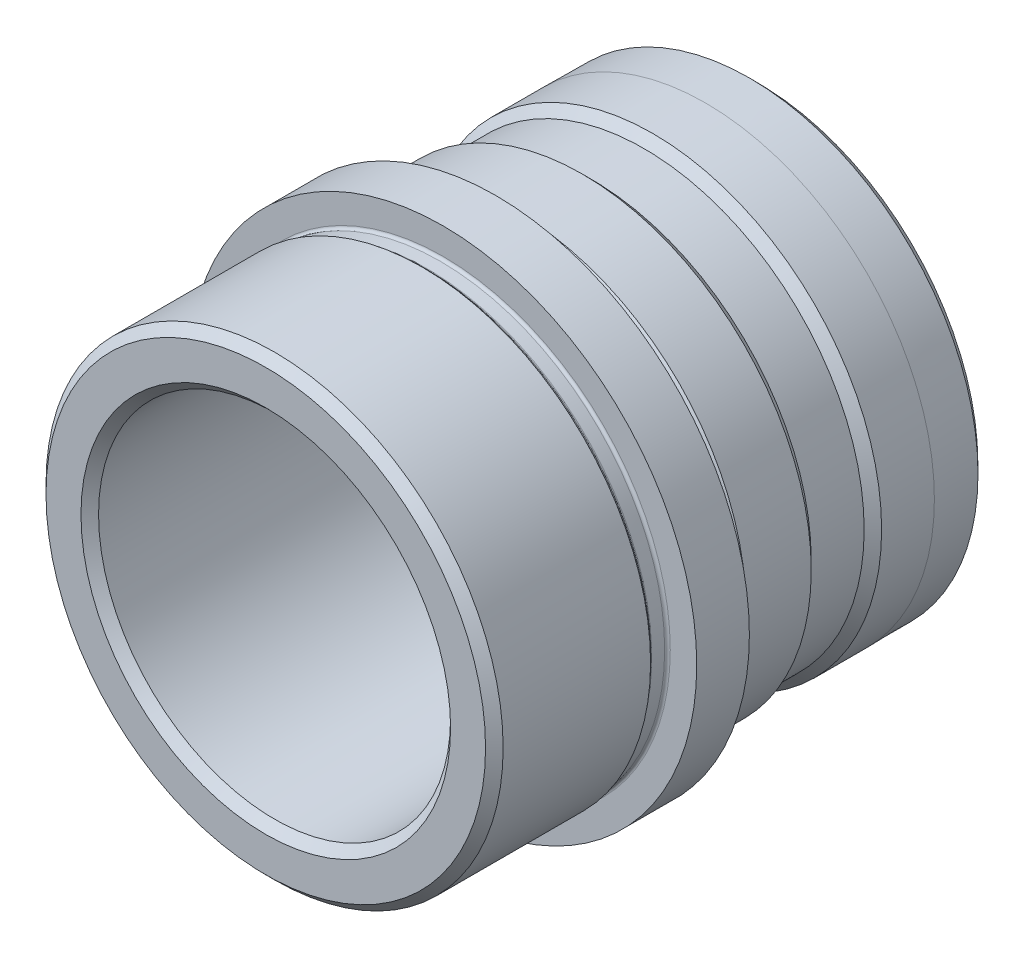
ISO-10303-21;
HEADER;
FILE_DESCRIPTION(('STEP AP214'),'2;1');
FILE_NAME('part.step','',(''),(''),'','','');
FILE_SCHEMA(('AUTOMOTIVE_DESIGN { 1 0 10303 214 1 1 1 1 }'));
ENDSEC;
DATA;
#1=APPLICATION_CONTEXT('core data for automotive mechanical design processes');
#2=APPLICATION_PROTOCOL_DEFINITION('international standard','automotive_design',2000,#1);
#3=PRODUCT_CONTEXT('',#1,'mechanical');
#4=PRODUCT('Part','Part','',(#3));
#5=PRODUCT_RELATED_PRODUCT_CATEGORY('part','',(#4));
#6=PRODUCT_DEFINITION_FORMATION('','',#4);
#7=PRODUCT_DEFINITION_CONTEXT('part definition',#1,'design');
#8=PRODUCT_DEFINITION('design','',#6,#7);
#9=PRODUCT_DEFINITION_SHAPE('','',#8);
#10=(LENGTH_UNIT() NAMED_UNIT(*) SI_UNIT(.MILLI.,.METRE.));
#11=(NAMED_UNIT(*) PLANE_ANGLE_UNIT() SI_UNIT($,.RADIAN.));
#12=(NAMED_UNIT(*) SI_UNIT($,.STERADIAN.) SOLID_ANGLE_UNIT());
#13=UNCERTAINTY_MEASURE_WITH_UNIT(LENGTH_MEASURE(1.E-05),#10,'distance_accuracy_value','');
#14=(GEOMETRIC_REPRESENTATION_CONTEXT(3) GLOBAL_UNCERTAINTY_ASSIGNED_CONTEXT((#13)) GLOBAL_UNIT_ASSIGNED_CONTEXT((#10,
#11,#12)) REPRESENTATION_CONTEXT('',''));
#15=CARTESIAN_POINT('',(0.,0.,0.));
#16=DIRECTION('',(0.,0.,1.));
#17=DIRECTION('',(1.,0.,0.));
#18=AXIS2_PLACEMENT_3D('',#15,#16,#17);
#19=CARTESIAN_POINT('',(0.,15.88262,16.002));
#20=DIRECTION('',(0.,0.,1.));
#21=DIRECTION('',(1.,0.,0.));
#22=AXIS2_PLACEMENT_3D('',#19,#20,#21);
#23=PLANE('',#22);
#24=CARTESIAN_POINT('',(0.,0.,16.002));
#25=DIRECTION('',(0.,0.,1.));
#26=DIRECTION('',(1.,0.,0.));
#27=AXIS2_PLACEMENT_3D('',#24,#25,#26);
#28=CIRCLE('',#27,19.83105);
#29=CARTESIAN_POINT('',(19.83105,0.,16.002));
#30=VERTEX_POINT('',#29);
#31=EDGE_CURVE('E66',#30,#30,#28,.T.);
#32=ORIENTED_EDGE('',*,*,#31,.T.);
#33=EDGE_LOOP('',(#32));
#34=FACE_BOUND('',#33,.T.);
#35=CARTESIAN_POINT('',(0.,0.,16.002));
#36=DIRECTION('',(0.,0.,1.));
#37=DIRECTION('',(1.,0.,0.));
#38=AXIS2_PLACEMENT_3D('',#35,#36,#37);
#39=CIRCLE('',#38,16.67637);
#40=CARTESIAN_POINT('',(16.67637,0.,16.002));
#41=VERTEX_POINT('',#40);
#42=EDGE_CURVE('E69',#41,#41,#39,.F.);
#43=ORIENTED_EDGE('',*,*,#42,.T.);
#44=EDGE_LOOP('',(#43));
#45=FACE_BOUND('',#44,.T.);
#46=ADVANCED_FACE('F31',(#34,#45),#23,.T.);
#47=CARTESIAN_POINT('',(0.,0.,0.));
#48=DIRECTION('',(0.,0.,-1.));
#49=DIRECTION('',(-1.,0.,0.));
#50=AXIS2_PLACEMENT_3D('',#47,#48,#49);
#51=CYLINDRICAL_SURFACE('',#50,20.6248);
#52=CARTESIAN_POINT('',(0.,0.,15.20825));
#53=DIRECTION('',(0.,0.,1.));
#54=DIRECTION('',(1.,0.,0.));
#55=AXIS2_PLACEMENT_3D('',#52,#53,#54);
#56=CIRCLE('',#55,20.6248);
#57=CARTESIAN_POINT('',(20.6248,0.,15.20825));
#58=VERTEX_POINT('',#57);
#59=EDGE_CURVE('E72',#58,#58,#56,.F.);
#60=ORIENTED_EDGE('',*,*,#59,.T.);
#61=EDGE_LOOP('',(#60));
#62=FACE_BOUND('',#61,.T.);
#63=CARTESIAN_POINT('',(0.,0.,1.905));
#64=DIRECTION('',(0.,0.,-1.));
#65=DIRECTION('',(-1.,0.,0.));
#66=AXIS2_PLACEMENT_3D('',#63,#64,#65);
#67=CIRCLE('',#66,20.6248);
#68=CARTESIAN_POINT('',(-20.6248,0.,1.905));
#69=VERTEX_POINT('',#68);
#70=EDGE_CURVE('E87',#69,#69,#67,.T.);
#71=ORIENTED_EDGE('',*,*,#70,.F.);
#72=EDGE_LOOP('',(#71));
#73=FACE_BOUND('',#72,.T.);
#74=ADVANCED_FACE('F156',(#62,#73),#51,.T.);
#75=CARTESIAN_POINT('',(0.,0.,1.524));
#76=DIRECTION('',(0.,0.,1.));
#77=DIRECTION('',(1.,0.,0.));
#78=AXIS2_PLACEMENT_3D('',#75,#76,#77);
#79=CONICAL_SURFACE('',#78,20.2438,0.785398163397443);
#80=CARTESIAN_POINT('',(0.,0.,1.59839487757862));
#81=DIRECTION('',(0.,0.,1.));
#82=DIRECTION('',(1.,0.,0.));
#83=AXIS2_PLACEMENT_3D('',#80,#81,#82);
#84=CIRCLE('',#83,20.3181948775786);
#85=CARTESIAN_POINT('',(20.3181948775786,0.,1.59839487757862));
#86=VERTEX_POINT('',#85);
#87=EDGE_CURVE('E38',#86,#86,#84,.T.);
#88=ORIENTED_EDGE('',*,*,#87,.T.);
#89=EDGE_LOOP('',(#88));
#90=FACE_BOUND('',#89,.T.);
#91=ORIENTED_EDGE('',*,*,#70,.T.);
#92=EDGE_LOOP('',(#91));
#93=FACE_BOUND('',#92,.T.);
#94=ADVANCED_FACE('F152',(#90,#93),#79,.T.);
#95=CARTESIAN_POINT('',(0.,0.,0.));
#96=DIRECTION('',(0.,0.,-1.));
#97=DIRECTION('',(-1.,0.,0.));
#98=AXIS2_PLACEMENT_3D('',#95,#96,#97);
#99=CYLINDRICAL_SURFACE('',#98,20.2438);
#100=CARTESIAN_POINT('',(0.,0.,1.41878975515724));
#101=DIRECTION('',(0.,0.,-1.));
#102=DIRECTION('',(-1.,0.,0.));
#103=AXIS2_PLACEMENT_3D('',#100,#101,#102);
#104=CIRCLE('',#103,20.2438);
#105=CARTESIAN_POINT('',(-20.2438,0.,1.41878975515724));
#106=VERTEX_POINT('',#105);
#107=EDGE_CURVE('E42',#106,#106,#104,.T.);
#108=ORIENTED_EDGE('',*,*,#107,.T.);
#109=EDGE_LOOP('',(#108));
#110=FACE_BOUND('',#109,.T.);
#111=CARTESIAN_POINT('',(0.,0.,0.254));
#112=DIRECTION('',(0.,0.,1.));
#113=DIRECTION('',(1.,0.,0.));
#114=AXIS2_PLACEMENT_3D('',#111,#112,#113);
#115=CIRCLE('',#114,20.2438);
#116=CARTESIAN_POINT('',(20.2438,0.,0.254));
#117=VERTEX_POINT('',#116);
#118=EDGE_CURVE('E46',#117,#117,#115,.T.);
#119=ORIENTED_EDGE('',*,*,#118,.T.);
#120=EDGE_LOOP('',(#119));
#121=FACE_BOUND('',#120,.T.);
#122=ADVANCED_FACE('F149',(#110,#121),#99,.T.);
#123=CARTESIAN_POINT('',(0.,22.8854,0.));
#124=DIRECTION('',(0.,0.,1.));
#125=DIRECTION('',(1.,0.,0.));
#126=AXIS2_PLACEMENT_3D('',#123,#124,#125);
#127=PLANE('',#126);
#128=CARTESIAN_POINT('',(0.,0.,0.));
#129=DIRECTION('',(0.,0.,1.));
#130=DIRECTION('',(1.,0.,0.));
#131=AXIS2_PLACEMENT_3D('',#128,#129,#130);
#132=CIRCLE('',#131,20.4978);
#133=CARTESIAN_POINT('',(20.4978,0.,0.));
#134=VERTEX_POINT('',#133);
#135=EDGE_CURVE('E10',#134,#134,#132,.F.);
#136=ORIENTED_EDGE('',*,*,#135,.T.);
#137=EDGE_LOOP('',(#136));
#138=FACE_BOUND('',#137,.T.);
#139=CARTESIAN_POINT('',(0.,0.,0.));
#140=DIRECTION('',(0.,0.,-1.));
#141=DIRECTION('',(-1.,0.,0.));
#142=AXIS2_PLACEMENT_3D('',#139,#140,#141);
#143=CIRCLE('',#142,22.8854);
#144=CARTESIAN_POINT('',(-22.8854,0.,0.));
#145=VERTEX_POINT('',#144);
#146=EDGE_CURVE('E386',#145,#145,#143,.T.);
#147=ORIENTED_EDGE('',*,*,#146,.F.);
#148=EDGE_LOOP('',(#147));
#149=FACE_BOUND('',#148,.T.);
#150=ADVANCED_FACE('F145',(#138,#149),#127,.T.);
#151=CARTESIAN_POINT('',(0.,0.,0.));
#152=DIRECTION('',(0.,0.,-1.));
#153=DIRECTION('',(-1.,0.,0.));
#154=AXIS2_PLACEMENT_3D('',#151,#152,#153);
#155=CYLINDRICAL_SURFACE('',#154,22.8854);
#156=ORIENTED_EDGE('',*,*,#146,.T.);
#157=EDGE_LOOP('',(#156));
#158=FACE_BOUND('',#157,.T.);
#159=CARTESIAN_POINT('',(0.,0.,-4.7498));
#160=DIRECTION('',(0.,0.,-1.));
#161=DIRECTION('',(-1.,0.,0.));
#162=AXIS2_PLACEMENT_3D('',#159,#160,#161);
#163=CIRCLE('',#162,22.8854);
#164=CARTESIAN_POINT('',(-22.8854,0.,-4.7498));
#165=VERTEX_POINT('',#164);
#166=EDGE_CURVE('E384',#165,#165,#163,.T.);
#167=ORIENTED_EDGE('',*,*,#166,.F.);
#168=EDGE_LOOP('',(#167));
#169=FACE_BOUND('',#168,.T.);
#170=ADVANCED_FACE('F141',(#158,#169),#155,.T.);
#171=CARTESIAN_POINT('',(0.,22.8854,-4.7498));
#172=DIRECTION('',(0.,0.,-1.));
#173=DIRECTION('',(-1.,0.,0.));
#174=AXIS2_PLACEMENT_3D('',#171,#172,#173);
#175=PLANE('',#174);
#176=CARTESIAN_POINT('',(0.,0.,-4.7498));
#177=DIRECTION('',(0.,0.,-1.));
#178=DIRECTION('',(-1.,0.,0.));
#179=AXIS2_PLACEMENT_3D('',#176,#177,#178);
#180=CIRCLE('',#179,20.4978);
#181=CARTESIAN_POINT('',(-20.4978,0.,-4.7498));
#182=VERTEX_POINT('',#181);
#183=EDGE_CURVE('E51',#182,#182,#180,.F.);
#184=ORIENTED_EDGE('',*,*,#183,.T.);
#185=EDGE_LOOP('',(#184));
#186=FACE_BOUND('',#185,.T.);
#187=ORIENTED_EDGE('',*,*,#166,.T.);
#188=EDGE_LOOP('',(#187));
#189=FACE_BOUND('',#188,.T.);
#190=ADVANCED_FACE('F137',(#186,#189),#175,.T.);
#191=CARTESIAN_POINT('',(0.,0.,0.));
#192=DIRECTION('',(0.,0.,-1.));
#193=DIRECTION('',(-1.,0.,0.));
#194=AXIS2_PLACEMENT_3D('',#191,#192,#193);
#195=CYLINDRICAL_SURFACE('',#194,20.2438);
#196=CARTESIAN_POINT('',(0.,0.,-6.16858975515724));
#197=DIRECTION('',(0.,0.,-1.));
#198=DIRECTION('',(-1.,0.,0.));
#199=AXIS2_PLACEMENT_3D('',#196,#197,#198);
#200=CIRCLE('',#199,20.2438);
#201=CARTESIAN_POINT('',(-20.2438,0.,-6.16858975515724));
#202=VERTEX_POINT('',#201);
#203=EDGE_CURVE('E54',#202,#202,#200,.F.);
#204=ORIENTED_EDGE('',*,*,#203,.T.);
#205=EDGE_LOOP('',(#204));
#206=FACE_BOUND('',#205,.T.);
#207=CARTESIAN_POINT('',(0.,0.,-5.0038));
#208=DIRECTION('',(0.,0.,-1.));
#209=DIRECTION('',(-1.,0.,0.));
#210=AXIS2_PLACEMENT_3D('',#207,#208,#209);
#211=CIRCLE('',#210,20.2438);
#212=CARTESIAN_POINT('',(-20.2438,0.,-5.0038));
#213=VERTEX_POINT('',#212);
#214=EDGE_CURVE('E57',#213,#213,#211,.T.);
#215=ORIENTED_EDGE('',*,*,#214,.T.);
#216=EDGE_LOOP('',(#215));
#217=FACE_BOUND('',#216,.T.);
#218=ADVANCED_FACE('F133',(#206,#217),#195,.T.);
#219=CARTESIAN_POINT('',(0.,0.,-6.67385));
#220=DIRECTION('',(0.,0.,-1.));
#221=DIRECTION('',(-1.,0.,0.));
#222=AXIS2_PLACEMENT_3D('',#219,#220,#221);
#223=CONICAL_SURFACE('',#222,20.64385,0.78539816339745);
#224=CARTESIAN_POINT('',(0.,0.,-6.34819487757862));
#225=DIRECTION('',(0.,0.,-1.));
#226=DIRECTION('',(-1.,0.,0.));
#227=AXIS2_PLACEMENT_3D('',#224,#225,#226);
#228=CIRCLE('',#227,20.3181948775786);
#229=CARTESIAN_POINT('',(-20.3181948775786,0.,-6.34819487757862));
#230=VERTEX_POINT('',#229);
#231=EDGE_CURVE('E60',#230,#230,#228,.T.);
#232=ORIENTED_EDGE('',*,*,#231,.T.);
#233=EDGE_LOOP('',(#232));
#234=FACE_BOUND('',#233,.T.);
#235=CARTESIAN_POINT('',(0.,0.,-6.67385));
#236=DIRECTION('',(0.,0.,-1.));
#237=DIRECTION('',(-1.,0.,0.));
#238=AXIS2_PLACEMENT_3D('',#235,#236,#237);
#239=CIRCLE('',#238,20.64385);
#240=CARTESIAN_POINT('',(-20.64385,0.,-6.67385));
#241=VERTEX_POINT('',#240);
#242=EDGE_CURVE('E381',#241,#241,#239,.T.);
#243=ORIENTED_EDGE('',*,*,#242,.F.);
#244=EDGE_LOOP('',(#243));
#245=FACE_BOUND('',#244,.T.);
#246=ADVANCED_FACE('F129',(#234,#245),#223,.T.);
#247=CARTESIAN_POINT('',(0.,0.,0.));
#248=DIRECTION('',(0.,0.,-1.));
#249=DIRECTION('',(-1.,0.,0.));
#250=AXIS2_PLACEMENT_3D('',#247,#248,#249);
#251=CYLINDRICAL_SURFACE('',#250,20.64385);
#252=ORIENTED_EDGE('',*,*,#242,.T.);
#253=EDGE_LOOP('',(#252));
#254=FACE_BOUND('',#253,.T.);
#255=CARTESIAN_POINT('',(0.,0.,-12.573));
#256=DIRECTION('',(0.,0.,-1.));
#257=DIRECTION('',(-1.,0.,0.));
#258=AXIS2_PLACEMENT_3D('',#255,#256,#257);
#259=CIRCLE('',#258,20.64385);
#260=CARTESIAN_POINT('',(-20.64385,0.,-12.573));
#261=VERTEX_POINT('',#260);
#262=EDGE_CURVE('E378',#261,#261,#259,.T.);
#263=ORIENTED_EDGE('',*,*,#262,.F.);
#264=EDGE_LOOP('',(#263));
#265=FACE_BOUND('',#264,.T.);
#266=ADVANCED_FACE('F125',(#254,#265),#251,.T.);
#267=CARTESIAN_POINT('',(0.,0.,-13.3604));
#268=DIRECTION('',(0.,0.,1.));
#269=DIRECTION('',(1.,0.,0.));
#270=AXIS2_PLACEMENT_3D('',#267,#268,#269);
#271=CONICAL_SURFACE('',#270,19.85645,0.785398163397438);
#272=ORIENTED_EDGE('',*,*,#262,.T.);
#273=EDGE_LOOP('',(#272));
#274=FACE_BOUND('',#273,.T.);
#275=CARTESIAN_POINT('',(0.,0.,-13.3604));
#276=DIRECTION('',(0.,0.,-1.));
#277=DIRECTION('',(-1.,0.,0.));
#278=AXIS2_PLACEMENT_3D('',#275,#276,#277);
#279=CIRCLE('',#278,19.85645);
#280=CARTESIAN_POINT('',(-19.85645,0.,-13.3604));
#281=VERTEX_POINT('',#280);
#282=EDGE_CURVE('E372',#281,#281,#279,.T.);
#283=ORIENTED_EDGE('',*,*,#282,.F.);
#284=EDGE_LOOP('',(#283));
#285=FACE_BOUND('',#284,.T.);
#286=ADVANCED_FACE('F120',(#274,#285),#271,.T.);
#287=CARTESIAN_POINT('',(0.,0.,0.));
#288=DIRECTION('',(0.,0.,-1.));
#289=DIRECTION('',(-1.,0.,0.));
#290=AXIS2_PLACEMENT_3D('',#287,#288,#289);
#291=CYLINDRICAL_SURFACE('',#290,19.85645);
#292=CARTESIAN_POINT('',(0.,-19.85645,-13.3731));
#293=CARTESIAN_POINT('',(-0.132890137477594,-19.856448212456,-13.373105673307));
#294=CARTESIAN_POINT('',(-0.265864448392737,-19.8551018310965,-13.3842916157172));
#295=CARTESIAN_POINT('',(-0.528116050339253,-19.8498603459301,-13.4287397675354));
#296=CARTESIAN_POINT('',(-0.657389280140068,-19.8459625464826,-13.4620253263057));
#297=CARTESIAN_POINT('',(-0.90840387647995,-19.8360575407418,-13.5496807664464));
#298=CARTESIAN_POINT('',(-1.03015013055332,-19.8300517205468,-13.6040367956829));
#299=CARTESIAN_POINT('',(-1.26276829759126,-19.8165994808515,-13.7322606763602));
#300=CARTESIAN_POINT('',(-1.37364214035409,-19.809153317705,-13.8061250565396));
#301=CARTESIAN_POINT('',(-1.5819530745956,-19.7936102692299,-13.9716687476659));
#302=CARTESIAN_POINT('',(-1.67932726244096,-19.7855105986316,-14.0634269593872));
#303=CARTESIAN_POINT('',(-1.85733327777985,-19.7695960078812,-14.2619844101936));
#304=CARTESIAN_POINT('',(-1.93796427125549,-19.7617811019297,-14.3687843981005));
#305=CARTESIAN_POINT('',(-2.08042697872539,-19.747293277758,-14.5947993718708));
#306=CARTESIAN_POINT('',(-2.14220018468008,-19.7406239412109,-14.7140514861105));
#307=CARTESIAN_POINT('',(-2.24482018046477,-19.729218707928,-14.9613298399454));
#308=CARTESIAN_POINT('',(-2.28566769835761,-19.7244827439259,-15.0893557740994));
#309=CARTESIAN_POINT('',(-2.34508662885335,-19.7175068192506,-15.3498969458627));
#310=CARTESIAN_POINT('',(-2.36376388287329,-19.7152550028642,-15.482387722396));
#311=CARTESIAN_POINT('',(-2.37863953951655,-19.7134659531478,-15.7486409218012));
#312=CARTESIAN_POINT('',(-2.37483877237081,-19.7139286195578,-15.8824032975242));
#313=CARTESIAN_POINT('',(-2.34495323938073,-19.7175054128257,-16.146666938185));
#314=CARTESIAN_POINT('',(-2.3189848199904,-19.7206056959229,-16.2771815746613));
#315=CARTESIAN_POINT('',(-2.24568254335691,-19.7290868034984,-16.5319870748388));
#316=CARTESIAN_POINT('',(-2.19834828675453,-19.7344676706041,-16.6562778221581));
#317=CARTESIAN_POINT('',(-2.08353213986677,-19.7469194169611,-16.8954702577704));
#318=CARTESIAN_POINT('',(-2.01599944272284,-19.7539945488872,-17.0103473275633));
#319=CARTESIAN_POINT('',(-1.86273980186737,-19.7690342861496,-17.2271817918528));
#320=CARTESIAN_POINT('',(-1.77701209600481,-19.7769989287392,-17.3291386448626));
#321=CARTESIAN_POINT('',(-1.58914995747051,-19.7929818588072,-17.5179139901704));
#322=CARTESIAN_POINT('',(-1.48691519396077,-19.8010001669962,-17.6046326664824));
#323=CARTESIAN_POINT('',(-1.26928714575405,-19.8161397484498,-17.7596936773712));
#324=CARTESIAN_POINT('',(-1.15389383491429,-19.8232610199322,-17.8280359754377));
#325=CARTESIAN_POINT('',(-0.913149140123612,-19.8358080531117,-17.944403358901));
#326=CARTESIAN_POINT('',(-0.787794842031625,-19.8412333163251,-17.9924224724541));
#327=CARTESIAN_POINT('',(-0.530723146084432,-19.8497724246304,-18.0667025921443));
#328=CARTESIAN_POINT('',(-0.399006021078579,-19.8528863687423,-18.092964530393));
#329=CARTESIAN_POINT('',(-0.133811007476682,-19.8564391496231,-18.1228560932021));
#330=CARTESIAN_POINT('',(-0.000348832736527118,-19.8568942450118,-18.1266232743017));
#331=CARTESIAN_POINT('',(0.26530501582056,-19.8551218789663,-18.1117809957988));
#332=CARTESIAN_POINT('',(0.397496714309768,-19.8528944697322,-18.0931719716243));
#333=CARTESIAN_POINT('',(0.656453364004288,-19.8460175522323,-18.034219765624));
#334=CARTESIAN_POINT('',(0.783233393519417,-19.8413753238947,-17.9939418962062));
#335=CARTESIAN_POINT('',(1.02823890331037,-19.8301887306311,-17.8928630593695));
#336=CARTESIAN_POINT('',(1.14646411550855,-19.8236443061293,-17.8320614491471));
#337=CARTESIAN_POINT('',(1.37162013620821,-19.8093429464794,-17.6913263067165));
#338=CARTESIAN_POINT('',(1.47849476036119,-19.8015804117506,-17.6113034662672));
#339=CARTESIAN_POINT('',(1.67734488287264,-19.7857294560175,-17.4345241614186));
#340=CARTESIAN_POINT('',(1.76931984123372,-19.7776410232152,-17.3377670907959));
#341=CARTESIAN_POINT('',(1.93624541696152,-19.7620000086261,-17.1296612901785));
#342=CARTESIAN_POINT('',(2.01110505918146,-19.7544504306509,-17.0182393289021));
#343=CARTESIAN_POINT('',(2.14104724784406,-19.7407905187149,-16.7843233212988));
#344=CARTESIAN_POINT('',(2.19613016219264,-19.7346801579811,-16.6618294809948));
#345=CARTESIAN_POINT('',(2.28480682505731,-19.7246106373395,-16.40954471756));
#346=CARTESIAN_POINT('',(2.3184525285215,-19.7206462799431,-16.2797722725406));
#347=CARTESIAN_POINT('',(2.363467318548,-19.7153024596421,-16.0163693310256));
#348=CARTESIAN_POINT('',(2.37483734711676,-19.7139228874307,-15.8827389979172));
#349=CARTESIAN_POINT('',(2.37496174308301,-19.7139078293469,-15.6163183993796));
#350=CARTESIAN_POINT('',(2.36385902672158,-19.7152550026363,-15.4835281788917));
#351=CARTESIAN_POINT('',(2.31965504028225,-19.7205044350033,-15.2217152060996));
#352=CARTESIAN_POINT('',(2.28655376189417,-19.7244066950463,-15.0926924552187));
#353=CARTESIAN_POINT('',(2.19933577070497,-19.7343213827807,-14.8420916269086));
#354=CARTESIAN_POINT('',(2.14522532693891,-19.7403331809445,-14.7205113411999));
#355=CARTESIAN_POINT('',(2.01753913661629,-19.7537906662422,-14.4881338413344));
#356=CARTESIAN_POINT('',(1.9439632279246,-19.7612363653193,-14.3773367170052));
#357=CARTESIAN_POINT('',(1.77890262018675,-19.776779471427,-14.1689394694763));
#358=CARTESIAN_POINT('',(1.68731134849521,-19.7848805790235,-14.0714240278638));
#359=CARTESIAN_POINT('',(1.48904061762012,-19.8007887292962,-13.8930907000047));
#360=CARTESIAN_POINT('',(1.38235759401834,-19.8085957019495,-13.8122767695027));
#361=CARTESIAN_POINT('',(1.15650780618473,-19.82306574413,-13.6694035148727));
#362=CARTESIAN_POINT('',(1.03729874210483,-19.8297247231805,-13.6074106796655));
#363=CARTESIAN_POINT('',(0.79015156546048,-19.8411065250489,-13.50441032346));
#364=CARTESIAN_POINT('',(0.66222319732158,-19.8458314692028,-13.4633797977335));
#365=CARTESIAN_POINT('',(0.444681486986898,-19.8516624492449,-13.4133868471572));
#366=CARTESIAN_POINT('',(0.356444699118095,-19.8534491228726,-13.3983007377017));
#367=CARTESIAN_POINT('',(0.178817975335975,-19.8558434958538,-13.3781554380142));
#368=CARTESIAN_POINT('',(0.0894280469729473,-19.8564512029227,-13.3730961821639));
#369=CARTESIAN_POINT('',(0.,-19.85645,-13.3731));
#370=B_SPLINE_CURVE_WITH_KNOTS('',3,(#292,#293,#294,#295,#296,#297,#298,#299,#300,#301,#302,
#303,#304,#305,#306,#307,#308,#309,#310,#311,#312,#313,#314,#315,#316,#317,#318,#319,#320,#321,
#322,#323,#324,#325,#326,#327,#328,#329,#330,#331,#332,#333,#334,#335,#336,#337,#338,#339,#340,
#341,#342,#343,#344,#345,#346,#347,#348,#349,#350,#351,#352,#353,#354,#355,#356,#357,#358,#359,
#360,#361,#362,#363,#364,#365,#366,#367,#368,#369),.UNSPECIFIED.,.T.,.F.,(4,2,2,2,2,2,2,2,2,2,2,
2,2,2,2,2,2,2,2,2,2,2,2,2,2,2,2,2,2,2,2,2,2,2,2,2,2,2,4),(0.,0.398343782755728,
0.797109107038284,1.19561271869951,1.59404546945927,1.99427649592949,2.39452745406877,
2.79600789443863,3.19747436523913,3.59701641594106,3.99654370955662,4.39398689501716,
4.79143750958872,5.18989639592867,5.58837197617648,5.98936759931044,6.39036401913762,
6.79147818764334,7.19257517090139,7.5912168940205,7.98985085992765,8.38728997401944,
8.78474153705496,9.18407678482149,9.58342650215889,9.98485198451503,10.3862699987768,
10.7867114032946,11.1871358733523,11.5850218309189,11.9829079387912,12.380675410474,
12.7784461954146,13.1786449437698,13.5789383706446,13.9806298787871,14.3818796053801,
14.6499456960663,14.918010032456),.UNSPECIFIED.);
#371=CARTESIAN_POINT('',(0.,-19.85645,-13.3731));
#372=VERTEX_POINT('',#371);
#373=EDGE_CURVE('E95',#372,#372,#370,.T.);
#374=ORIENTED_EDGE('',*,*,#373,.F.);
#375=EDGE_LOOP('',(#374));
#376=FACE_BOUND('',#375,.T.);
#377=ORIENTED_EDGE('',*,*,#282,.T.);
#378=EDGE_LOOP('',(#377));
#379=FACE_BOUND('',#378,.T.);
#380=CARTESIAN_POINT('',(0.,0.,-18.1356));
#381=DIRECTION('',(0.,0.,-1.));
#382=DIRECTION('',(-1.,0.,0.));
#383=AXIS2_PLACEMENT_3D('',#380,#381,#382);
#384=CIRCLE('',#383,19.85645);
#385=CARTESIAN_POINT('',(-19.85645,0.,-18.1356));
#386=VERTEX_POINT('',#385);
#387=EDGE_CURVE('E368',#386,#386,#384,.T.);
#388=ORIENTED_EDGE('',*,*,#387,.F.);
#389=EDGE_LOOP('',(#388));
#390=FACE_BOUND('',#389,.T.);
#391=ADVANCED_FACE('F114',(#376,#379,#390),#291,.T.);
#392=CARTESIAN_POINT('',(0.,0.,-18.923));
#393=DIRECTION('',(0.,0.,-1.));
#394=DIRECTION('',(-1.,0.,0.));
#395=AXIS2_PLACEMENT_3D('',#392,#393,#394);
#396=CONICAL_SURFACE('',#395,20.64385,0.785398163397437);
#397=ORIENTED_EDGE('',*,*,#387,.T.);
#398=EDGE_LOOP('',(#397));
#399=FACE_BOUND('',#398,.T.);
#400=CARTESIAN_POINT('',(0.,0.,-18.923));
#401=DIRECTION('',(0.,0.,-1.));
#402=DIRECTION('',(-1.,0.,0.));
#403=AXIS2_PLACEMENT_3D('',#400,#401,#402);
#404=CIRCLE('',#403,20.64385);
#405=CARTESIAN_POINT('',(-20.64385,0.,-18.923));
#406=VERTEX_POINT('',#405);
#407=EDGE_CURVE('E371',#406,#406,#404,.T.);
#408=ORIENTED_EDGE('',*,*,#407,.F.);
#409=EDGE_LOOP('',(#408));
#410=FACE_BOUND('',#409,.T.);
#411=ADVANCED_FACE('F119',(#399,#410),#396,.T.);
#412=CARTESIAN_POINT('',(0.,0.,0.));
#413=DIRECTION('',(0.,0.,-1.));
#414=DIRECTION('',(-1.,0.,0.));
#415=AXIS2_PLACEMENT_3D('',#412,#413,#414);
#416=CYLINDRICAL_SURFACE('',#415,20.64385);
#417=ORIENTED_EDGE('',*,*,#407,.T.);
#418=EDGE_LOOP('',(#417));
#419=FACE_BOUND('',#418,.T.);
#420=CARTESIAN_POINT('',(0.,0.,-23.6855));
#421=DIRECTION('',(0.,0.,-1.));
#422=DIRECTION('',(-1.,0.,0.));
#423=AXIS2_PLACEMENT_3D('',#420,#421,#422);
#424=CIRCLE('',#423,20.64385);
#425=CARTESIAN_POINT('',(-20.64385,0.,-23.6855));
#426=VERTEX_POINT('',#425);
#427=EDGE_CURVE('E112',#426,#426,#424,.T.);
#428=ORIENTED_EDGE('',*,*,#427,.F.);
#429=EDGE_LOOP('',(#428));
#430=FACE_BOUND('',#429,.T.);
#431=ADVANCED_FACE('F301',(#419,#430),#416,.T.);
#432=CARTESIAN_POINT('',(0.,0.,-28.448));
#433=DIRECTION('',(0.,0.,1.));
#434=DIRECTION('',(1.,0.,0.));
#435=AXIS2_PLACEMENT_3D('',#432,#433,#434);
#436=CONICAL_SURFACE('',#435,20.6022882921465,0.00872664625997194);
#437=CARTESIAN_POINT('',(0.,0.,-27.6542802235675));
#438=DIRECTION('',(0.,0.,-1.));
#439=DIRECTION('',(-1.,0.,0.));
#440=AXIS2_PLACEMENT_3D('',#437,#438,#439);
#441=CIRCLE('',#440,20.6092149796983);
#442=CARTESIAN_POINT('',(-20.6092149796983,0.,-27.6542802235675));
#443=VERTEX_POINT('',#442);
#444=EDGE_CURVE('E75',#443,#443,#441,.F.);
#445=ORIENTED_EDGE('',*,*,#444,.T.);
#446=EDGE_LOOP('',(#445));
#447=FACE_BOUND('',#446,.T.);
#448=ORIENTED_EDGE('',*,*,#427,.T.);
#449=EDGE_LOOP('',(#448));
#450=FACE_BOUND('',#449,.T.);
#451=ADVANCED_FACE('F292',(#447,#450),#436,.T.);
#452=CARTESIAN_POINT('',(0.,20.6022882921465,-28.448));
#453=DIRECTION('',(0.,0.,-1.));
#454=DIRECTION('',(-1.,0.,0.));
#455=AXIS2_PLACEMENT_3D('',#452,#453,#454);
#456=PLANE('',#455);
#457=CARTESIAN_POINT('',(0.,0.,-28.448));
#458=DIRECTION('',(0.,0.,-1.));
#459=DIRECTION('',(-1.,0.,0.));
#460=AXIS2_PLACEMENT_3D('',#457,#458,#459);
#461=CIRCLE('',#460,19.8015198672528);
#462=CARTESIAN_POINT('',(-19.8015198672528,0.,-28.448));
#463=VERTEX_POINT('',#462);
#464=EDGE_CURVE('E78',#463,#463,#461,.T.);
#465=ORIENTED_EDGE('',*,*,#464,.T.);
#466=EDGE_LOOP('',(#465));
#467=FACE_BOUND('',#466,.T.);
#468=CARTESIAN_POINT('',(0.,0.,-28.448));
#469=DIRECTION('',(0.,0.,-1.));
#470=DIRECTION('',(-1.,0.,0.));
#471=AXIS2_PLACEMENT_3D('',#468,#469,#470);
#472=CIRCLE('',#471,18.93062);
#473=CARTESIAN_POINT('',(-18.93062,0.,-28.448));
#474=VERTEX_POINT('',#473);
#475=EDGE_CURVE('E81',#474,#474,#472,.F.);
#476=ORIENTED_EDGE('',*,*,#475,.T.);
#477=EDGE_LOOP('',(#476));
#478=FACE_BOUND('',#477,.T.);
#479=ADVANCED_FACE('F282',(#467,#478),#456,.T.);
#480=CARTESIAN_POINT('',(0.,0.,0.));
#481=DIRECTION('',(0.,0.,-1.));
#482=DIRECTION('',(-1.,0.,0.));
#483=AXIS2_PLACEMENT_3D('',#480,#481,#482);
#484=CYLINDRICAL_SURFACE('',#483,15.88262);
#485=CARTESIAN_POINT('',(0.,0.,15.20825));
#486=DIRECTION('',(0.,0.,1.));
#487=DIRECTION('',(1.,0.,0.));
#488=AXIS2_PLACEMENT_3D('',#485,#486,#487);
#489=CIRCLE('',#488,15.88262);
#490=CARTESIAN_POINT('',(15.88262,0.,15.20825));
#491=VERTEX_POINT('',#490);
#492=EDGE_CURVE('E63',#491,#491,#489,.T.);
#493=ORIENTED_EDGE('',*,*,#492,.T.);
#494=EDGE_LOOP('',(#493));
#495=FACE_BOUND('',#494,.T.);
#496=CARTESIAN_POINT('',(0.,0.,-25.4));
#497=DIRECTION('',(0.,0.,-1.));
#498=DIRECTION('',(-1.,0.,0.));
#499=AXIS2_PLACEMENT_3D('',#496,#497,#498);
#500=CIRCLE('',#499,15.88262);
#501=CARTESIAN_POINT('',(-15.88262,0.,-25.4));
#502=VERTEX_POINT('',#501);
#503=EDGE_CURVE('E84',#502,#502,#500,.T.);
#504=ORIENTED_EDGE('',*,*,#503,.T.);
#505=EDGE_LOOP('',(#504));
#506=FACE_BOUND('',#505,.T.);
#507=CARTESIAN_POINT('',(0.,-15.88262,-13.3731));
#508=CARTESIAN_POINT('',(0.132605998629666,-15.8826178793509,-13.373105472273));
#509=CARTESIAN_POINT('',(0.265289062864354,-15.8809418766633,-13.3842438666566));
#510=CARTESIAN_POINT('',(0.526946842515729,-15.8744172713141,-13.4284920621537));
#511=CARTESIAN_POINT('',(0.65591781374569,-15.8695655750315,-13.461623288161));
#512=CARTESIAN_POINT('',(0.906326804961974,-15.8572348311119,-13.5488453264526));
#513=CARTESIAN_POINT('',(1.02777042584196,-15.849757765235,-13.6029203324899));
#514=CARTESIAN_POINT('',(1.25984133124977,-15.8330026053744,-13.7304563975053));
#515=CARTESIAN_POINT('',(1.37047012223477,-15.82372476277,-13.8039147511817));
#516=CARTESIAN_POINT('',(1.57864869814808,-15.8043192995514,-13.9687401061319));
#517=CARTESIAN_POINT('',(1.6761023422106,-15.7941862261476,-14.0602279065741));
#518=CARTESIAN_POINT('',(1.85433481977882,-15.7742550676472,-14.2582552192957));
#519=CARTESIAN_POINT('',(1.93511269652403,-15.7644570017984,-14.3647955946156));
#520=CARTESIAN_POINT('',(2.07807457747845,-15.7462522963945,-14.5905493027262));
#521=CARTESIAN_POINT('',(2.14016562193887,-15.737852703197,-14.7098221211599));
#522=CARTESIAN_POINT('',(2.24339724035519,-15.7234703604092,-14.9572501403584));
#523=CARTESIAN_POINT('',(2.28453894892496,-15.7174874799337,-15.0854048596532));
#524=CARTESIAN_POINT('',(2.34440558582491,-15.7086695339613,-15.3459480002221));
#525=CARTESIAN_POINT('',(2.36329506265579,-15.7058113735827,-15.4782978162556));
#526=CARTESIAN_POINT('',(2.37863077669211,-15.7034963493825,-15.7443171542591));
#527=CARTESIAN_POINT('',(2.37507829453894,-15.7040392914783,-15.8779866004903));
#528=CARTESIAN_POINT('',(2.34576541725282,-15.7084440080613,-16.1416887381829));
#529=CARTESIAN_POINT('',(2.32018824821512,-15.7122783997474,-16.2717423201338));
#530=CARTESIAN_POINT('',(2.24783884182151,-15.7227912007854,-16.5256909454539));
#531=CARTESIAN_POINT('',(2.20106600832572,-15.7294696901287,-16.6495858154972));
#532=CARTESIAN_POINT('',(2.08746228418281,-15.7449484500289,-16.8882578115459));
#533=CARTESIAN_POINT('',(2.02055374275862,-15.7537569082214,-17.0029974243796));
#534=CARTESIAN_POINT('',(1.86863319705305,-15.772497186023,-17.2196901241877));
#535=CARTESIAN_POINT('',(1.78362001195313,-15.7824290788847,-17.3216423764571));
#536=CARTESIAN_POINT('',(1.59689743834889,-15.8024181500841,-17.5109282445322));
#537=CARTESIAN_POINT('',(1.49503051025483,-15.8124755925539,-17.598106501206));
#538=CARTESIAN_POINT('',(1.27802912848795,-15.8314908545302,-17.7541533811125));
#539=CARTESIAN_POINT('',(1.16289461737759,-15.8404486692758,-17.8230219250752));
#540=CARTESIAN_POINT('',(0.922491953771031,-15.8562646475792,-17.9405022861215));
#541=CARTESIAN_POINT('',(0.797217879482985,-15.863121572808,-17.9891021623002));
#542=CARTESIAN_POINT('',(0.54016087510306,-15.8739528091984,-18.0645307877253));
#543=CARTESIAN_POINT('',(0.408378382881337,-15.8779273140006,-18.0913609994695));
#544=CARTESIAN_POINT('',(0.143386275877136,-15.8825202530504,-18.1222822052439));
#545=CARTESIAN_POINT('',(0.0102021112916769,-15.8831702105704,-18.1265867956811));
#546=CARTESIAN_POINT('',(-0.254986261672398,-15.881126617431,-18.11290145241));
#547=CARTESIAN_POINT('',(-0.386990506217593,-15.8784331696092,-18.0949122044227));
#548=CARTESIAN_POINT('',(-0.645425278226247,-15.8700249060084,-18.0373274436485));
#549=CARTESIAN_POINT('',(-0.771879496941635,-15.8643246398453,-17.9978359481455));
#550=CARTESIAN_POINT('',(-1.01637180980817,-15.8505398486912,-17.8984773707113));
#551=CARTESIAN_POINT('',(-1.13440951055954,-15.8424552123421,-17.8386093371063));
#552=CARTESIAN_POINT('',(-1.35965765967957,-15.8247218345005,-17.6996956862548));
#553=CARTESIAN_POINT('',(-1.46678364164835,-15.8150622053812,-17.6205145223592));
#554=CARTESIAN_POINT('',(-1.66630292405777,-15.795288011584,-17.4454110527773));
#555=CARTESIAN_POINT('',(-1.7586953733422,-15.7851734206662,-17.3494877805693));
#556=CARTESIAN_POINT('',(-1.92690171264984,-15.7655293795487,-17.1426723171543));
#557=CARTESIAN_POINT('',(-2.00257245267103,-15.7560054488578,-17.0316630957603));
#558=CARTESIAN_POINT('',(-2.13419246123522,-15.7387186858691,-16.7983840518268));
#559=CARTESIAN_POINT('',(-2.1901422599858,-15.7309558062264,-16.6761145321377));
#560=CARTESIAN_POINT('',(-2.28051011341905,-15.7181099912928,-16.4242132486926));
#561=CARTESIAN_POINT('',(-2.3150036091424,-15.7130176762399,-16.294609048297));
#562=CARTESIAN_POINT('',(-2.36171987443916,-15.7060645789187,-16.0313653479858));
#563=CARTESIAN_POINT('',(-2.37394417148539,-15.7042035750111,-15.8977261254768));
#564=CARTESIAN_POINT('',(-2.37573886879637,-15.7039320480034,-15.631632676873));
#565=CARTESIAN_POINT('',(-2.36553434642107,-15.7054872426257,-15.4991799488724));
#566=CARTESIAN_POINT('',(-2.32324328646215,-15.711798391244,-15.237896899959));
#567=CARTESIAN_POINT('',(-2.29115678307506,-15.7165543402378,-15.1090665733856));
#568=CARTESIAN_POINT('',(-2.20609198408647,-15.728719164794,-14.8587470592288));
#569=CARTESIAN_POINT('',(-2.1531293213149,-15.7361260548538,-14.7372524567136));
#570=CARTESIAN_POINT('',(-2.02783801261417,-15.7527606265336,-14.5048371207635));
#571=CARTESIAN_POINT('',(-1.95550871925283,-15.7619883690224,-14.3939167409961));
#572=CARTESIAN_POINT('',(-1.79271923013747,-15.7813351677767,-14.1846547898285));
#573=CARTESIAN_POINT('',(-1.7020923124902,-15.7914619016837,-14.0864436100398));
#574=CARTESIAN_POINT('',(-1.50563242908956,-15.8114014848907,-13.9065431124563));
#575=CARTESIAN_POINT('',(-1.39979593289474,-15.8212142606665,-13.8248576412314));
#576=CARTESIAN_POINT('',(-1.17524072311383,-15.8394815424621,-13.6799286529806));
#577=CARTESIAN_POINT('',(-1.05645473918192,-15.8479283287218,-13.616788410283));
#578=CARTESIAN_POINT('',(-0.809893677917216,-15.8624361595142,-13.5114497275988));
#579=CARTESIAN_POINT('',(-0.682128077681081,-15.8684996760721,-13.4692295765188));
#580=CARTESIAN_POINT('',(-0.461489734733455,-15.8761721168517,-13.4165183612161));
#581=CARTESIAN_POINT('',(-0.369979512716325,-15.8785776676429,-13.4002613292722));
#582=CARTESIAN_POINT('',(-0.185658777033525,-15.881802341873,-13.3785502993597));
#583=CARTESIAN_POINT('',(-0.0928482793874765,-15.8826214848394,-13.3730961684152));
#584=CARTESIAN_POINT('',(0.,-15.88262,-13.3731));
#585=B_SPLINE_CURVE_WITH_KNOTS('',3,(#507,#508,#509,#510,#511,#512,#513,#514,#515,#516,#517,
#518,#519,#520,#521,#522,#523,#524,#525,#526,#527,#528,#529,#530,#531,#532,#533,#534,#535,#536,
#537,#538,#539,#540,#541,#542,#543,#544,#545,#546,#547,#548,#549,#550,#551,#552,#553,#554,#555,
#556,#557,#558,#559,#560,#561,#562,#563,#564,#565,#566,#567,#568,#569,#570,#571,#572,#573,#574,
#575,#576,#577,#578,#579,#580,#581,#582,#583,#584),.UNSPECIFIED.,.T.,.F.,(4,2,2,2,2,2,2,2,2,2,2,
2,2,2,2,2,2,2,2,2,2,2,2,2,2,2,2,2,2,2,2,2,2,2,2,2,2,2,4),(0.,0.397478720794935,
0.795345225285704,1.19291204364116,1.59042340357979,1.99069469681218,2.39098894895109,
2.79324279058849,3.19547484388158,3.59471346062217,3.99392929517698,4.38985574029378,
4.78579332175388,5.18327778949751,5.58078818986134,5.98224928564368,6.38371211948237,
6.78541113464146,7.18708316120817,7.58493938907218,7.98278337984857,8.37871967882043,
8.77467447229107,9.17349249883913,9.57233355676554,9.97446700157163,10.3765896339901,
10.7772902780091,11.1779634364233,11.5746341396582,11.9713042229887,12.3676778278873,
12.764064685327,13.1642410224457,13.5645103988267,13.9669682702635,14.3690075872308,
14.6473182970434,14.9256255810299),.UNSPECIFIED.);
#586=CARTESIAN_POINT('',(0.,-15.88262,-13.3731));
#587=VERTEX_POINT('',#586);
#588=EDGE_CURVE('E88',#587,#587,#585,.T.);
#589=ORIENTED_EDGE('',*,*,#588,.F.);
#590=EDGE_LOOP('',(#589));
#591=FACE_BOUND('',#590,.T.);
#592=ADVANCED_FACE('F97',(#495,#506,#591),#484,.F.);
#593=CARTESIAN_POINT('',(0.,-22.8854,-15.748));
#594=DIRECTION('',(0.,1.,0.));
#595=DIRECTION('',(0.,0.,1.));
#596=AXIS2_PLACEMENT_3D('',#593,#594,#595);
#597=CYLINDRICAL_SURFACE('',#596,2.3749);
#598=ORIENTED_EDGE('',*,*,#373,.T.);
#599=EDGE_LOOP('',(#598));
#600=FACE_BOUND('',#599,.T.);
#601=ORIENTED_EDGE('',*,*,#588,.T.);
#602=EDGE_LOOP('',(#601));
#603=FACE_BOUND('',#602,.T.);
#604=ADVANCED_FACE('F100',(#600,#603),#597,.F.);
#605=CARTESIAN_POINT('',(0.,0.,-25.4));
#606=DIRECTION('',(0.,0.,-1.));
#607=DIRECTION('',(-1.,0.,0.));
#608=AXIS2_PLACEMENT_3D('',#605,#606,#607);
#609=TOROIDAL_SURFACE('',#608,18.93062,3.048);
#610=ORIENTED_EDGE('',*,*,#475,.F.);
#611=EDGE_LOOP('',(#610));
#612=FACE_BOUND('',#611,.T.);
#613=ORIENTED_EDGE('',*,*,#503,.F.);
#614=EDGE_LOOP('',(#613));
#615=FACE_BOUND('',#614,.T.);
#616=ADVANCED_FACE('F103',(#612,#615),#609,.T.);
#617=CARTESIAN_POINT('',(0.,0.,-28.448));
#618=DIRECTION('',(0.,0.,1.));
#619=DIRECTION('',(1.,0.,0.));
#620=AXIS2_PLACEMENT_3D('',#617,#618,#619);
#621=CONICAL_SURFACE('',#620,19.8015198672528,0.794124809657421);
#622=ORIENTED_EDGE('',*,*,#444,.F.);
#623=EDGE_LOOP('',(#622));
#624=FACE_BOUND('',#623,.T.);
#625=ORIENTED_EDGE('',*,*,#464,.F.);
#626=EDGE_LOOP('',(#625));
#627=FACE_BOUND('',#626,.T.);
#628=ADVANCED_FACE('F165',(#624,#627),#621,.T.);
#629=CARTESIAN_POINT('',(0.,0.,15.20825));
#630=DIRECTION('',(0.,0.,-1.));
#631=DIRECTION('',(-1.,0.,0.));
#632=AXIS2_PLACEMENT_3D('',#629,#630,#631);
#633=CONICAL_SURFACE('',#632,20.6248,0.785398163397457);
#634=ORIENTED_EDGE('',*,*,#31,.F.);
#635=EDGE_LOOP('',(#634));
#636=FACE_BOUND('',#635,.T.);
#637=ORIENTED_EDGE('',*,*,#59,.F.);
#638=EDGE_LOOP('',(#637));
#639=FACE_BOUND('',#638,.T.);
#640=ADVANCED_FACE('F169',(#636,#639),#633,.T.);
#641=CARTESIAN_POINT('',(0.,0.,16.002));
#642=DIRECTION('',(0.,0.,1.));
#643=DIRECTION('',(1.,0.,0.));
#644=AXIS2_PLACEMENT_3D('',#641,#642,#643);
#645=CONICAL_SURFACE('',#644,16.67637,0.785398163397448);
#646=CARTESIAN_POINT('',(15.88262,0.,15.20825));
#647=CARTESIAN_POINT('',(15.8908882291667,0.,15.2165182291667));
#648=CARTESIAN_POINT('',(15.8991564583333,0.,15.2247864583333));
#649=CARTESIAN_POINT('',(15.9156929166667,0.,15.2413229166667));
#650=CARTESIAN_POINT('',(15.9239611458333,0.,15.2495911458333));
#651=CARTESIAN_POINT('',(15.9404976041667,0.,15.2661276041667));
#652=CARTESIAN_POINT('',(15.9487658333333,0.,15.2743958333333));
#653=CARTESIAN_POINT('',(15.9653022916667,0.,15.2909322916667));
#654=CARTESIAN_POINT('',(15.9735705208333,0.,15.2992005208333));
#655=CARTESIAN_POINT('',(15.9901069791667,0.,15.3157369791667));
#656=CARTESIAN_POINT('',(15.9983752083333,0.,15.3240052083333));
#657=CARTESIAN_POINT('',(16.0149116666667,0.,15.3405416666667));
#658=CARTESIAN_POINT('',(16.0231798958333,0.,15.3488098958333));
#659=CARTESIAN_POINT('',(16.0397163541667,0.,15.3653463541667));
#660=CARTESIAN_POINT('',(16.0479845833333,0.,15.3736145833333));
#661=CARTESIAN_POINT('',(16.0645210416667,0.,15.3901510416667));
#662=CARTESIAN_POINT('',(16.0727892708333,0.,15.3984192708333));
#663=CARTESIAN_POINT('',(16.0893257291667,0.,15.4149557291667));
#664=CARTESIAN_POINT('',(16.0975939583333,0.,15.4232239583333));
#665=CARTESIAN_POINT('',(16.1141304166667,0.,15.4397604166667));
#666=CARTESIAN_POINT('',(16.1223986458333,0.,15.4480286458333));
#667=CARTESIAN_POINT('',(16.1389351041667,0.,15.4645651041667));
#668=CARTESIAN_POINT('',(16.1472033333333,0.,15.4728333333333));
#669=CARTESIAN_POINT('',(16.1637397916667,0.,15.4893697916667));
#670=CARTESIAN_POINT('',(16.1720080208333,0.,15.4976380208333));
#671=CARTESIAN_POINT('',(16.1885444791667,0.,15.5141744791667));
#672=CARTESIAN_POINT('',(16.1968127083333,0.,15.5224427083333));
#673=CARTESIAN_POINT('',(16.2133491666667,0.,15.5389791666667));
#674=CARTESIAN_POINT('',(16.2216173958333,0.,15.5472473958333));
#675=CARTESIAN_POINT('',(16.2381538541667,0.,15.5637838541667));
#676=CARTESIAN_POINT('',(16.2464220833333,0.,15.5720520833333));
#677=CARTESIAN_POINT('',(16.2629585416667,0.,15.5885885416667));
#678=CARTESIAN_POINT('',(16.2712267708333,0.,15.5968567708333));
#679=CARTESIAN_POINT('',(16.2877632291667,0.,15.6133932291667));
#680=CARTESIAN_POINT('',(16.2960314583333,0.,15.6216614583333));
#681=CARTESIAN_POINT('',(16.3125679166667,0.,15.6381979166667));
#682=CARTESIAN_POINT('',(16.3208361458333,0.,15.6464661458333));
#683=CARTESIAN_POINT('',(16.3373726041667,0.,15.6630026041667));
#684=CARTESIAN_POINT('',(16.3456408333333,0.,15.6712708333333));
#685=CARTESIAN_POINT('',(16.3621772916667,0.,15.6878072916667));
#686=CARTESIAN_POINT('',(16.3704455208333,0.,15.6960755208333));
#687=CARTESIAN_POINT('',(16.3869819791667,0.,15.7126119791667));
#688=CARTESIAN_POINT('',(16.3952502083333,0.,15.7208802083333));
#689=CARTESIAN_POINT('',(16.4117866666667,0.,15.7374166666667));
#690=CARTESIAN_POINT('',(16.4200548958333,0.,15.7456848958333));
#691=CARTESIAN_POINT('',(16.4365913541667,0.,15.7622213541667));
#692=CARTESIAN_POINT('',(16.4448595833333,0.,15.7704895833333));
#693=CARTESIAN_POINT('',(16.4613960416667,0.,15.7870260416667));
#694=CARTESIAN_POINT('',(16.4696642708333,0.,15.7952942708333));
#695=CARTESIAN_POINT('',(16.4862007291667,0.,15.8118307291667));
#696=CARTESIAN_POINT('',(16.4944689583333,0.,15.8200989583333));
#697=CARTESIAN_POINT('',(16.5110054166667,0.,15.8366354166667));
#698=CARTESIAN_POINT('',(16.5192736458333,0.,15.8449036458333));
#699=CARTESIAN_POINT('',(16.5358101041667,0.,15.8614401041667));
#700=CARTESIAN_POINT('',(16.5440783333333,0.,15.8697083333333));
#701=CARTESIAN_POINT('',(16.5606147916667,0.,15.8862447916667));
#702=CARTESIAN_POINT('',(16.5688830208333,0.,15.8945130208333));
#703=CARTESIAN_POINT('',(16.5854194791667,0.,15.9110494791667));
#704=CARTESIAN_POINT('',(16.5936877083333,0.,15.9193177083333));
#705=CARTESIAN_POINT('',(16.6102241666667,0.,15.9358541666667));
#706=CARTESIAN_POINT('',(16.6184923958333,0.,15.9441223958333));
#707=CARTESIAN_POINT('',(16.6350288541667,0.,15.9606588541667));
#708=CARTESIAN_POINT('',(16.6432970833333,0.,15.9689270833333));
#709=CARTESIAN_POINT('',(16.6598335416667,0.,15.9854635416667));
#710=CARTESIAN_POINT('',(16.6681017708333,0.,15.9937317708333));
#711=CARTESIAN_POINT('',(16.67637,0.,16.002));
#712=B_SPLINE_CURVE_WITH_KNOTS('',3,(#646,#647,#648,#649,#650,#651,#652,#653,#654,#655,#656,
#657,#658,#659,#660,#661,#662,#663,#664,#665,#666,#667,#668,#669,#670,#671,#672,#673,#674,#675,
#676,#677,#678,#679,#680,#681,#682,#683,#684,#685,#686,#687,#688,#689,#690,#691,#692,#693,#694,
#695,#696,#697,#698,#699,#700,#701,#702,#703,#704,#705,#706,#707,#708,#709,#710,#711),
.UNSPECIFIED.,.F.,.F.,(4,2,2,2,2,2,2,2,2,2,2,2,2,2,2,2,2,2,2,2,2,2,2,2,2,2,2,2,2,2,2,2,4),(0.,
0.0350791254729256,0.0701582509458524,0.10523737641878,0.140316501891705,0.175395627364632,
0.21047475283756,0.245553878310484,0.280633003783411,0.315712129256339,0.350791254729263,
0.38587038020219,0.420949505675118,0.456028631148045,0.491107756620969,0.526186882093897,
0.561266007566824,0.596345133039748,0.631424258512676,0.666503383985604,0.701582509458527,
0.736661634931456,0.771740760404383,0.806819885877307,0.841899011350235,0.876978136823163,
0.912057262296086,0.947136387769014,0.982215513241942,1.01729463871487,1.05237376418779,
1.08745288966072,1.12253201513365),.UNSPECIFIED.);
#713=EDGE_CURVE('BSEAM173',#491,#41,#712,.T.);
#714=ORIENTED_EDGE('',*,*,#492,.F.);
#715=ORIENTED_EDGE('',*,*,#42,.F.);
#716=ORIENTED_EDGE('',*,*,#713,.T.);
#717=ORIENTED_EDGE('',*,*,#713,.F.);
#718=EDGE_LOOP('',(#714,#716,#715,#717));
#719=FACE_BOUND('',#718,.T.);
#720=ADVANCED_FACE('F173',(#719),#645,.F.);
#721=CARTESIAN_POINT('',(0.,0.,-6.16858975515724));
#722=DIRECTION('',(0.,0.,-1.));
#723=DIRECTION('',(-1.,0.,0.));
#724=AXIS2_PLACEMENT_3D('',#721,#722,#723);
#725=TOROIDAL_SURFACE('',#724,20.4978,0.254);
#726=ORIENTED_EDGE('',*,*,#203,.F.);
#727=EDGE_LOOP('',(#726));
#728=FACE_BOUND('',#727,.T.);
#729=ORIENTED_EDGE('',*,*,#231,.F.);
#730=EDGE_LOOP('',(#729));
#731=FACE_BOUND('',#730,.T.);
#732=ADVANCED_FACE('F177',(#728,#731),#725,.F.);
#733=CARTESIAN_POINT('',(0.,0.,-5.0038));
#734=DIRECTION('',(0.,0.,-1.));
#735=DIRECTION('',(-1.,0.,0.));
#736=AXIS2_PLACEMENT_3D('',#733,#734,#735);
#737=TOROIDAL_SURFACE('',#736,20.4978,0.254);
#738=ORIENTED_EDGE('',*,*,#183,.F.);
#739=EDGE_LOOP('',(#738));
#740=FACE_BOUND('',#739,.T.);
#741=ORIENTED_EDGE('',*,*,#214,.F.);
#742=EDGE_LOOP('',(#741));
#743=FACE_BOUND('',#742,.T.);
#744=ADVANCED_FACE('F181',(#740,#743),#737,.F.);
#745=CARTESIAN_POINT('',(0.,0.,1.41878975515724));
#746=DIRECTION('',(0.,0.,-1.));
#747=DIRECTION('',(-1.,0.,0.));
#748=AXIS2_PLACEMENT_3D('',#745,#746,#747);
#749=TOROIDAL_SURFACE('',#748,20.4978,0.254);
#750=ORIENTED_EDGE('',*,*,#87,.F.);
#751=EDGE_LOOP('',(#750));
#752=FACE_BOUND('',#751,.T.);
#753=ORIENTED_EDGE('',*,*,#107,.F.);
#754=EDGE_LOOP('',(#753));
#755=FACE_BOUND('',#754,.T.);
#756=ADVANCED_FACE('F184',(#752,#755),#749,.F.);
#757=CARTESIAN_POINT('',(0.,0.,0.254));
#758=DIRECTION('',(0.,0.,1.));
#759=DIRECTION('',(1.,0.,0.));
#760=AXIS2_PLACEMENT_3D('',#757,#758,#759);
#761=TOROIDAL_SURFACE('',#760,20.4978,0.254);
#762=ORIENTED_EDGE('',*,*,#118,.F.);
#763=EDGE_LOOP('',(#762));
#764=FACE_BOUND('',#763,.T.);
#765=ORIENTED_EDGE('',*,*,#135,.F.);
#766=EDGE_LOOP('',(#765));
#767=FACE_BOUND('',#766,.T.);
#768=ADVANCED_FACE('F33',(#764,#767),#761,.F.);
#769=CLOSED_SHELL('',(#46,#74,#94,#122,#150,#170,#190,#218,#246,#266,#286,#391,#411,#431,#451,
#479,#592,#604,#616,#628,#640,#720,#732,#744,#756,#768));
#770=MANIFOLD_SOLID_BREP('B2',#769);
#771=ADVANCED_BREP_SHAPE_REPRESENTATION('',(#18,#770),#14);
#772=SHAPE_DEFINITION_REPRESENTATION(#9,#771);
ENDSEC;
END-ISO-10303-21;
